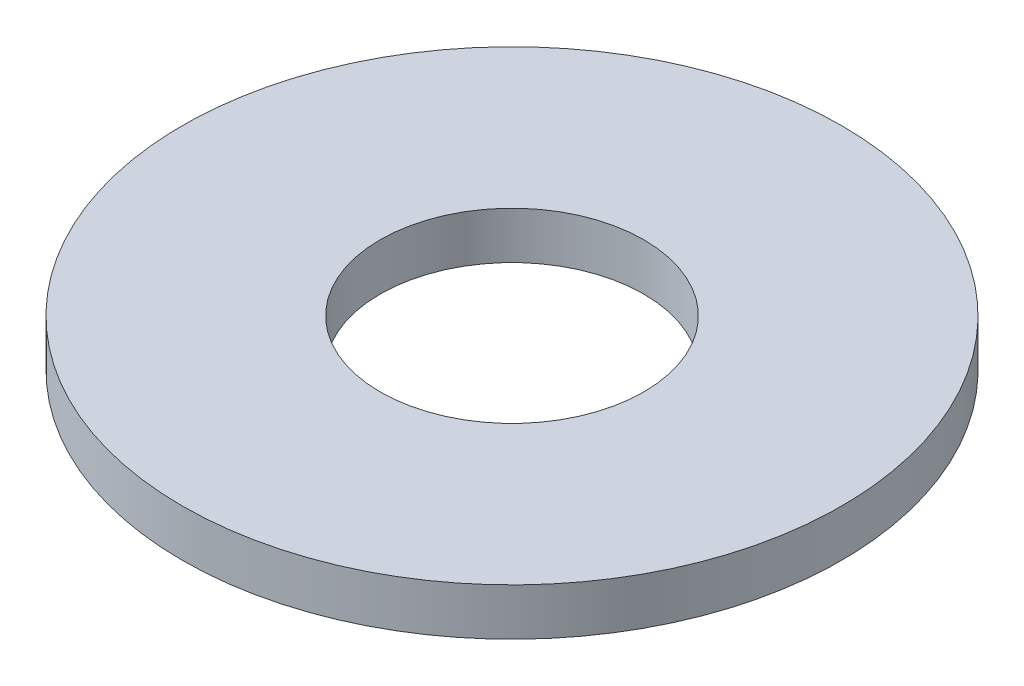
from build123d import *

# Parameters (mm, degrees)
SKETCH1_R      = 3.5
SKETCH1_R_2    = 1.4
EXTRUDE1_DEPTH = 0.5


with BuildPart() as part:
    # Sketch1 → Extrude1 (new body)
    with BuildSketch(Plane(origin=(0, 0, 0), x_dir=(1, 0, 0), z_dir=(0, 1, 0))):
        with Locations(Location((0, 0, 0), (0, 0, 270))):
            Circle(SKETCH1_R)
        with Locations(Location((0, 0, 0), (0, 0, 270))):
            Circle(SKETCH1_R_2, mode=Mode.SUBTRACT)
    extrude(amount=EXTRUDE1_DEPTH)


solid = part.part
